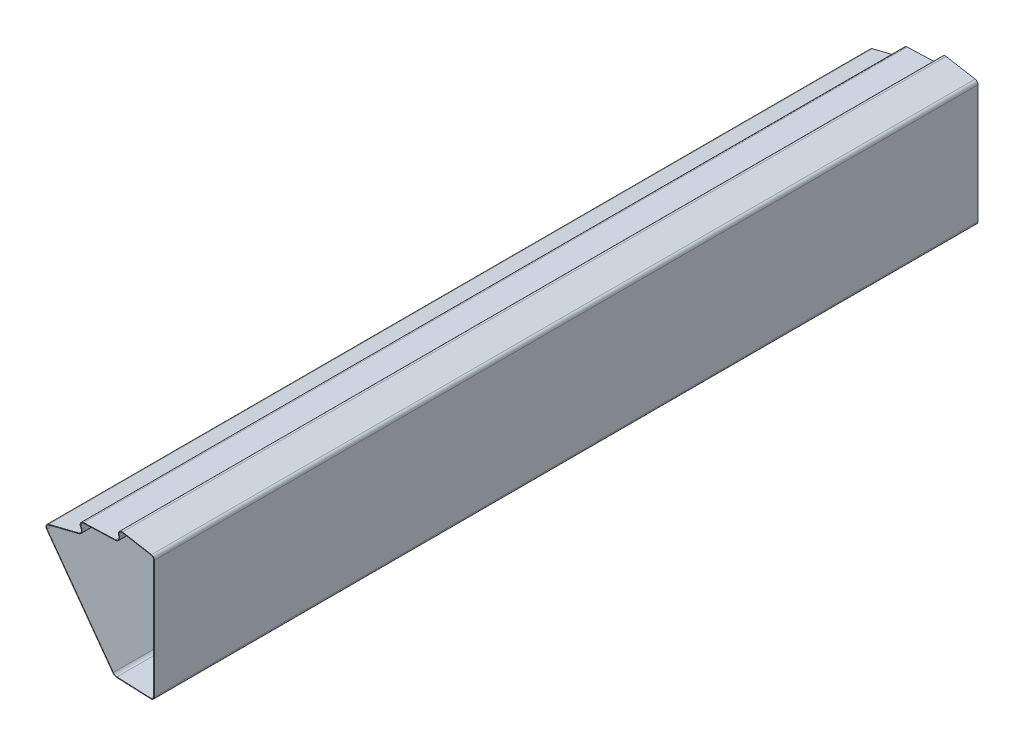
from build123d import *

# Parameters (mm, degrees)
EXTRUDE_THIN1_DEPTH      = 137.50025
EXTRUDE_THIN1_DEPTH_BACK = 213.5


with BuildPart() as part:
    # Sketch1 → Extrude-Thin1 (new, two sides: drawn at the far end of the back side and taken through both)
    with BuildSketch(Plane.XY.offset(-EXTRUDE_THIN1_DEPTH_BACK)):
        with BuildLine():
            Line((-1, 27.377741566), (-1, 77.801426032))
            ThreePointArc((-1, 77.801426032), (-1.350622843, 78.765237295), (-2.238576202, 79.278469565))
            Line((-2.238576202, 79.278469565), (-14.558703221, 81.459024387))
            ThreePointArc((-14.558703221, 81.459024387), (-15.894736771, 81.028505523), (-16.289731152, 79.681541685))
            Line((-16.289731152, 79.681541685), (-16.133756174, 78.918587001))
            ThreePointArc((-16.133756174, 78.918587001), (-16.425245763, 77.689683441), (-17.551976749, 77.11902818))
            Line((-17.551976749, 77.11902818), (-31.176844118, 76.65202466))
            ThreePointArc((-31.176844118, 76.65202466), (-32.394172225, 75.953136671), (-32.500485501, 74.553483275))
            Line((-32.500485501, 74.553483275), (-32.189291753, 73.839630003))
            ThreePointArc((-32.189291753, 73.839630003), (-32.218908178, 72.576976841), (-33.202371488, 71.784531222))
            Line((-33.202371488, 71.784531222), (-46.048094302, 68.590520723))
            ThreePointArc((-46.048094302, 68.590520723), (-47.095522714, 67.648327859), (-46.899674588, 66.253165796))
            Line((-46.899674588, 66.253165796), (-18.735090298, 27.487941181))
            ThreePointArc((-18.735090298, 27.487941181), (-17.958226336, 26.809018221), (-16.963801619, 26.534111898))
            Line((-16.963801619, 26.534111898), (-2.568160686, 25.879290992))
            ThreePointArc((-2.568160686, 25.879290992), (-1.463718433, 26.293250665), (-1, 27.377741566))
        make_face()
        with BuildLine():
            Line((-1.27, 27.377741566), (-1.27, 77.801426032))
            ThreePointArc((-1.27, 77.801426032), (-1.557510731, 78.591751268), (-2.285632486, 79.012601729))
            Line((-2.285632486, 79.012601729), (-14.605759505, 81.193156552))
            ThreePointArc((-14.605759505, 81.193156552), (-15.701307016, 80.840131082), (-16.025202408, 79.735620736))
            Line((-16.025202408, 79.735620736), (-15.86922743, 78.972666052))
            ThreePointArc((-15.86922743, 78.972666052), (-16.213185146, 77.522559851), (-17.542727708, 76.849186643))
            Line((-17.542727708, 76.849186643), (-31.167595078, 76.382183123))
            ThreePointArc((-31.167595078, 76.382183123), (-32.165804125, 75.809094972), (-32.252981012, 74.661379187))
            Line((-32.252981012, 74.661379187), (-31.941787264, 73.947525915))
            ThreePointArc((-31.941787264, 73.947525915), (-31.976734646, 72.457595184), (-33.137221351, 71.522509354))
            Line((-33.137221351, 71.522509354), (-45.982944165, 68.328498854))
            ThreePointArc((-45.982944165, 68.328498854), (-46.841835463, 67.555900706), (-46.68124, 66.411867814))
            Line((-46.68124, 66.411867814), (-18.516655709, 27.646643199))
            ThreePointArc((-18.516655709, 27.646643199), (-17.830213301, 27.046742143), (-16.951532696, 26.803833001))
            Line((-16.951532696, 26.803833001), (-2.555891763, 26.149012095))
            ThreePointArc((-2.555891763, 26.149012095), (-1.650249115, 26.488459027), (-1.27, 27.377741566))
        make_face(mode=Mode.SUBTRACT)
    extrude(amount=EXTRUDE_THIN1_DEPTH + EXTRUDE_THIN1_DEPTH_BACK)


solid = part.part
